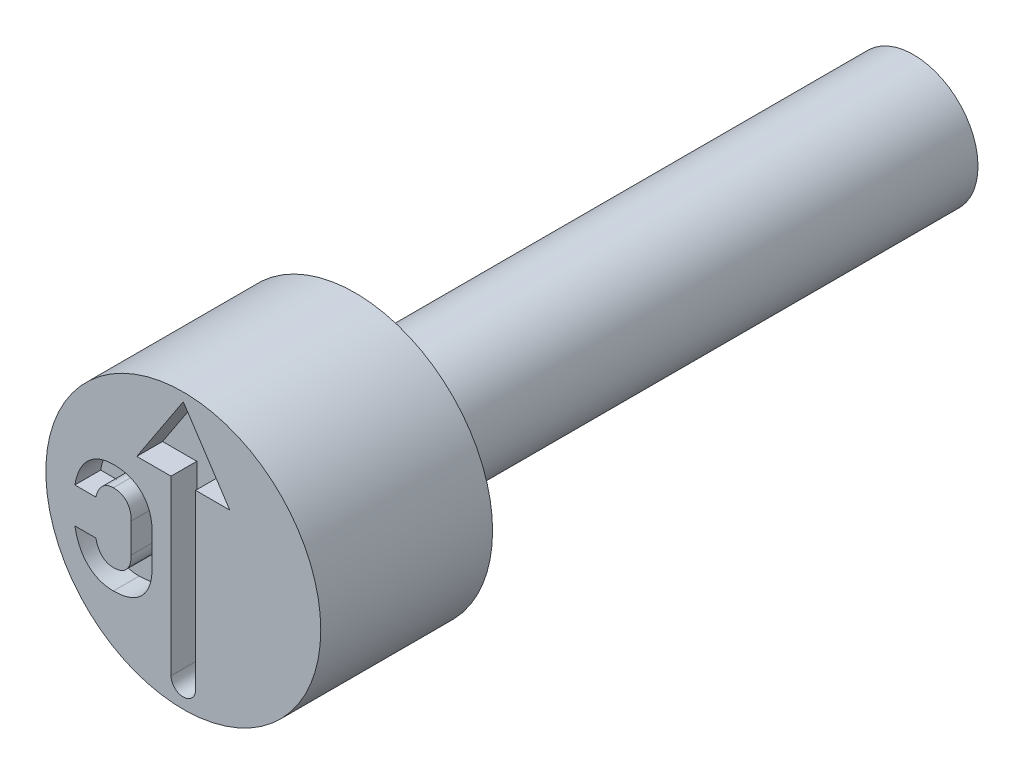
ISO-10303-21;
HEADER;
FILE_DESCRIPTION(('STEP AP214'),'2;1');
FILE_NAME('part.step','',(''),(''),'','','');
FILE_SCHEMA(('AUTOMOTIVE_DESIGN { 1 0 10303 214 1 1 1 1 }'));
ENDSEC;
DATA;
#1=APPLICATION_CONTEXT('core data for automotive mechanical design processes');
#2=APPLICATION_PROTOCOL_DEFINITION('international standard','automotive_design',2000,#1);
#3=PRODUCT_CONTEXT('',#1,'mechanical');
#4=PRODUCT('Part','Part','',(#3));
#5=PRODUCT_RELATED_PRODUCT_CATEGORY('part','',(#4));
#6=PRODUCT_DEFINITION_FORMATION('','',#4);
#7=PRODUCT_DEFINITION_CONTEXT('part definition',#1,'design');
#8=PRODUCT_DEFINITION('design','',#6,#7);
#9=PRODUCT_DEFINITION_SHAPE('','',#8);
#10=(LENGTH_UNIT() NAMED_UNIT(*) SI_UNIT(.MILLI.,.METRE.));
#11=(NAMED_UNIT(*) PLANE_ANGLE_UNIT() SI_UNIT($,.RADIAN.));
#12=(NAMED_UNIT(*) SI_UNIT($,.STERADIAN.) SOLID_ANGLE_UNIT());
#13=UNCERTAINTY_MEASURE_WITH_UNIT(LENGTH_MEASURE(1.E-05),#10,'distance_accuracy_value','');
#14=(GEOMETRIC_REPRESENTATION_CONTEXT(3) GLOBAL_UNCERTAINTY_ASSIGNED_CONTEXT((#13)) GLOBAL_UNIT_ASSIGNED_CONTEXT((#10,
#11,#12)) REPRESENTATION_CONTEXT('',''));
#15=CARTESIAN_POINT('',(0.,0.,0.));
#16=DIRECTION('',(0.,0.,1.));
#17=DIRECTION('',(1.,0.,0.));
#18=AXIS2_PLACEMENT_3D('',#15,#16,#17);
#19=CARTESIAN_POINT('',(0.,1.5,-4.));
#20=DIRECTION('',(0.,0.,1.));
#21=DIRECTION('',(1.,0.,0.));
#22=AXIS2_PLACEMENT_3D('',#19,#20,#21);
#23=PLANE('',#22);
#24=CARTESIAN_POINT('',(0.,0.,-4.));
#25=DIRECTION('',(0.,0.,1.));
#26=DIRECTION('',(1.,0.,0.));
#27=AXIS2_PLACEMENT_3D('',#24,#25,#26);
#28=CIRCLE('',#27,3.2);
#29=CARTESIAN_POINT('',(3.2,0.,-4.));
#30=VERTEX_POINT('',#29);
#31=EDGE_CURVE('E11',#30,#30,#28,.T.);
#32=ORIENTED_EDGE('',*,*,#31,.F.);
#33=EDGE_LOOP('',(#32));
#34=FACE_BOUND('',#33,.T.);
#35=CARTESIAN_POINT('',(0.,0.,-4.));
#36=DIRECTION('',(0.,0.,1.));
#37=DIRECTION('',(1.,0.,0.));
#38=AXIS2_PLACEMENT_3D('',#35,#36,#37);
#39=CIRCLE('',#38,1.5);
#40=CARTESIAN_POINT('',(1.5,0.,-4.));
#41=VERTEX_POINT('',#40);
#42=EDGE_CURVE('E262',#41,#41,#39,.T.);
#43=ORIENTED_EDGE('',*,*,#42,.T.);
#44=EDGE_LOOP('',(#43));
#45=FACE_BOUND('',#44,.T.);
#46=ADVANCED_FACE('F34',(#34,#45),#23,.F.);
#47=CARTESIAN_POINT('',(0.,0.,-0.403888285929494));
#48=DIRECTION('',(0.,0.,1.));
#49=DIRECTION('',(1.,0.,0.));
#50=AXIS2_PLACEMENT_3D('',#47,#48,#49);
#51=CYLINDRICAL_SURFACE('',#50,3.2);
#52=CARTESIAN_POINT('',(0.,0.,0.));
#53=DIRECTION('',(0.,0.,1.));
#54=DIRECTION('',(1.,0.,0.));
#55=AXIS2_PLACEMENT_3D('',#52,#53,#54);
#56=CIRCLE('',#55,3.2);
#57=CARTESIAN_POINT('',(3.2,0.,0.));
#58=VERTEX_POINT('',#57);
#59=EDGE_CURVE('E41',#58,#58,#56,.T.);
#60=ORIENTED_EDGE('',*,*,#59,.F.);
#61=EDGE_LOOP('',(#60));
#62=FACE_BOUND('',#61,.T.);
#63=ORIENTED_EDGE('',*,*,#31,.T.);
#64=EDGE_LOOP('',(#63));
#65=FACE_BOUND('',#64,.T.);
#66=ADVANCED_FACE('F247',(#62,#65),#51,.T.);
#67=CARTESIAN_POINT('',(0.,3.2,0.));
#68=DIRECTION('',(0.,0.,-1.));
#69=DIRECTION('',(-1.,0.,0.));
#70=AXIS2_PLACEMENT_3D('',#67,#68,#69);
#71=PLANE('',#70);
#72=CARTESIAN_POINT('',(-1.62798043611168,-1.62598328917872,0.));
#73=CARTESIAN_POINT('',(-1.60470520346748,-1.62573152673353,0.));
#74=CARTESIAN_POINT('',(-1.55877595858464,-1.62523472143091,0.));
#75=CARTESIAN_POINT('',(-1.49124071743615,-1.62006537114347,0.));
#76=CARTESIAN_POINT('',(-1.42608575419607,-1.61142404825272,0.));
#77=CARTESIAN_POINT('',(-1.36366637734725,-1.59923824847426,0.));
#78=CARTESIAN_POINT('',(-1.30381016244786,-1.58386551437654,0.));
#79=CARTESIAN_POINT('',(-1.24626084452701,-1.56569537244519,0.));
#80=CARTESIAN_POINT('',(-1.19157216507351,-1.54320154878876,0.));
#81=CARTESIAN_POINT('',(-1.13921332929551,-1.51769313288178,0.));
#82=CARTESIAN_POINT('',(-1.08992165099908,-1.48882154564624,0.));
#83=CARTESIAN_POINT('',(-1.04380158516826,-1.45634704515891,0.));
#84=CARTESIAN_POINT('',(-1.0003958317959,-1.4212885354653,0.));
#85=CARTESIAN_POINT('',(-0.960033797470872,-1.38294304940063,0.));
#86=CARTESIAN_POINT('',(-0.922757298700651,-1.34153464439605,0.));
#87=CARTESIAN_POINT('',(-0.888354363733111,-1.29701741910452,0.));
#88=CARTESIAN_POINT('',(-0.857531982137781,-1.24910737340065,0.));
#89=CARTESIAN_POINT('',(-0.829335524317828,-1.19845009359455,0.));
#90=CARTESIAN_POINT('',(-0.804249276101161,-1.14490712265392,0.));
#91=CARTESIAN_POINT('',(-0.783076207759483,-1.08822290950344,0.));
#92=CARTESIAN_POINT('',(-0.764719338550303,-1.02902336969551,0.));
#93=CARTESIAN_POINT('',(-0.749363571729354,-0.967317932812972,0.));
#94=CARTESIAN_POINT('',(-0.737606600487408,-0.902826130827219,0.));
#95=CARTESIAN_POINT('',(-0.729769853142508,-0.835596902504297,0.));
#96=CARTESIAN_POINT('',(-0.724337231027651,-0.765566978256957,0.));
#97=CARTESIAN_POINT('',(-0.723888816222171,-0.717937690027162,0.));
#98=CARTESIAN_POINT('',(-0.723660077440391,-0.693641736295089,0.));
#99=B_SPLINE_CURVE_WITH_KNOTS('',3,(#72,#73,#74,#75,#76,#77,#78,#79,#80,#81,#82,#83,#84,#85,#86,
#87,#88,#89,#90,#91,#92,#93,#94,#95,#96,#97,#98),.UNSPECIFIED.,.F.,.F.,(4,1,1,1,1,1,1,1,1,1,1,1,
1,1,1,1,1,1,1,1,1,1,1,1,4),(0.,0.0472598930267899,0.093258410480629,0.137448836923,
0.180669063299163,0.222325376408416,0.262898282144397,0.303117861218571,0.342294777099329,
0.381096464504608,0.418984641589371,0.456742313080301,0.494310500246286,0.531916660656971,
0.569787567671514,0.608434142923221,0.647492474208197,0.687453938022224,0.728384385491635,
0.770272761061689,0.813266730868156,0.85743965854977,0.903297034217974,0.950671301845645,1.),.UNSPECIFIED.);
#100=CARTESIAN_POINT('',(-1.62798043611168,-1.62598328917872,0.));
#101=VERTEX_POINT('',#100);
#102=CARTESIAN_POINT('',(-0.723660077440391,-0.693641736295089,0.));
#103=VERTEX_POINT('',#102);
#104=EDGE_CURVE('E400',#101,#103,#99,.T.);
#105=ORIENTED_EDGE('',*,*,#104,.F.);
#106=CARTESIAN_POINT('',(-2.52363969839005,-0.762421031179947,0.));
#107=CARTESIAN_POINT('',(-2.51493265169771,-0.806597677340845,0.));
#108=CARTESIAN_POINT('',(-2.49800456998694,-0.892485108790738,0.));
#109=CARTESIAN_POINT('',(-2.45996424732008,-1.01479487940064,0.));
#110=CARTESIAN_POINT('',(-2.41308611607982,-1.12717032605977,0.));
#111=CARTESIAN_POINT('',(-2.35729852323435,-1.22944289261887,0.));
#112=CARTESIAN_POINT('',(-2.29226136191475,-1.32060127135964,0.));
#113=CARTESIAN_POINT('',(-2.21953076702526,-1.40098638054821,0.));
#114=CARTESIAN_POINT('',(-2.1384921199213,-1.4699198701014,0.));
#115=CARTESIAN_POINT('',(-2.04931211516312,-1.52670905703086,0.));
#116=CARTESIAN_POINT('',(-1.9530185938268,-1.57135411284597,0.));
#117=CARTESIAN_POINT('',(-1.85013854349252,-1.60270726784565,0.));
#118=CARTESIAN_POINT('',(-1.74120212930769,-1.62299116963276,0.));
#119=CARTESIAN_POINT('',(-1.66628431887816,-1.62497102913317,0.));
#120=CARTESIAN_POINT('',(-1.62798043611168,-1.62598328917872,0.));
#121=B_SPLINE_CURVE_WITH_KNOTS('',3,(#106,#107,#108,#109,#110,#111,#112,#113,#114,#115,#116,
#117,#118,#119,#120),.UNSPECIFIED.,.F.,.F.,(4,1,1,1,1,1,1,1,1,1,1,1,4),(0.,0.098823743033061,
0.192131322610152,0.28071953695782,0.365844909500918,0.447392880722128,0.52606487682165,
0.603327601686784,0.680299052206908,0.757555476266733,0.835645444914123,0.915969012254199,1.),.UNSPECIFIED.);
#122=CARTESIAN_POINT('',(-2.52363969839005,-0.762421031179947,0.));
#123=VERTEX_POINT('',#122);
#124=EDGE_CURVE('E48',#123,#101,#121,.T.);
#125=ORIENTED_EDGE('',*,*,#124,.F.);
#126=DIRECTION('',(-1.,0.,0.));
#127=VECTOR('',#126,1.);
#128=CARTESIAN_POINT('',(-2.03556144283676,-0.762421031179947,0.));
#129=LINE('',#128,#127);
#130=CARTESIAN_POINT('',(-2.03556144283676,-0.762421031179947,0.));
#131=VERTEX_POINT('',#130);
#132=EDGE_CURVE('E185',#131,#123,#129,.T.);
#133=ORIENTED_EDGE('',*,*,#132,.F.);
#134=CARTESIAN_POINT('',(-1.62798043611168,-1.15471775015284,0.));
#135=CARTESIAN_POINT('',(-1.64481995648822,-1.15405416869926,0.));
#136=CARTESIAN_POINT('',(-1.67784877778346,-1.152752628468,0.));
#137=CARTESIAN_POINT('',(-1.72610053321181,-1.14478488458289,0.));
#138=CARTESIAN_POINT('',(-1.77153110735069,-1.13010074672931,0.));
#139=CARTESIAN_POINT('',(-1.81444709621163,-1.11031582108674,0.));
#140=CARTESIAN_POINT('',(-1.85453391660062,-1.08475412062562,0.));
#141=CARTESIAN_POINT('',(-1.89064880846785,-1.05317105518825,0.));
#142=CARTESIAN_POINT('',(-1.92428771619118,-1.01722018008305,0.));
#143=CARTESIAN_POINT('',(-1.95422741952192,-0.975731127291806,0.));
#144=CARTESIAN_POINT('',(-1.98076780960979,-0.929302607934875,0.));
#145=CARTESIAN_POINT('',(-2.00296295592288,-0.8779167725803,0.));
#146=CARTESIAN_POINT('',(-2.02222907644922,-0.822145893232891,0.));
#147=CARTESIAN_POINT('',(-2.03102630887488,-0.78273702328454,0.));
#148=CARTESIAN_POINT('',(-2.03556144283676,-0.762421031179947,0.));
#149=B_SPLINE_CURVE_WITH_KNOTS('',3,(#134,#135,#136,#137,#138,#139,#140,#141,#142,#143,#144,
#145,#146,#147,#148),.UNSPECIFIED.,.F.,.F.,(4,1,1,1,1,1,1,1,1,1,1,1,4),(0.,0.0817564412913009,
0.160356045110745,0.236478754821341,0.312819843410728,0.389192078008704,0.466352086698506,
0.545094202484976,0.627698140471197,0.714093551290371,0.80415108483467,0.89903630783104,1.),.UNSPECIFIED.);
#150=CARTESIAN_POINT('',(-1.62798043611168,-1.15471775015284,0.));
#151=VERTEX_POINT('',#150);
#152=EDGE_CURVE('E188',#151,#131,#149,.T.);
#153=ORIENTED_EDGE('',*,*,#152,.F.);
#154=CARTESIAN_POINT('',(-1.21173833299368,-0.693641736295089,0.));
#155=CARTESIAN_POINT('',(-1.21228750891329,-0.717108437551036,0.));
#156=CARTESIAN_POINT('',(-1.21335059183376,-0.762534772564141,0.));
#157=CARTESIAN_POINT('',(-1.2225605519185,-0.827978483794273,0.));
#158=CARTESIAN_POINT('',(-1.2377978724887,-0.888176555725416,0.));
#159=CARTESIAN_POINT('',(-1.25893792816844,-0.943026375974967,0.));
#160=CARTESIAN_POINT('',(-1.28670690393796,-0.991745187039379,0.));
#161=CARTESIAN_POINT('',(-1.31968459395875,-1.03472652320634,0.));
#162=CARTESIAN_POINT('',(-1.35806152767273,-1.07186656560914,0.));
#163=CARTESIAN_POINT('',(-1.4024333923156,-1.10208483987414,0.));
#164=CARTESIAN_POINT('',(-1.45193242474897,-1.12572189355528,0.));
#165=CARTESIAN_POINT('',(-1.50636920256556,-1.14233701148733,0.));
#166=CARTESIAN_POINT('',(-1.56559867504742,-1.15276668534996,0.));
#167=CARTESIAN_POINT('',(-1.60670678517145,-1.15405239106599,0.));
#168=CARTESIAN_POINT('',(-1.62798043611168,-1.15471775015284,0.));
#169=B_SPLINE_CURVE_WITH_KNOTS('',3,(#154,#155,#156,#157,#158,#159,#160,#161,#162,#163,#164,
#165,#166,#167,#168),.UNSPECIFIED.,.F.,.F.,(4,1,1,1,1,1,1,1,1,1,1,1,4),(0.,0.0997433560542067,
0.193081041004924,0.28029932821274,0.363302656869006,0.442209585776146,0.517891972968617,
0.592965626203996,0.668275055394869,0.745143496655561,0.825309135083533,0.909596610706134,1.),.UNSPECIFIED.);
#170=CARTESIAN_POINT('',(-1.21173833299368,-0.693641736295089,0.));
#171=VERTEX_POINT('',#170);
#172=EDGE_CURVE('E348',#171,#151,#169,.T.);
#173=ORIENTED_EDGE('',*,*,#172,.F.);
#174=DIRECTION('',(0.,-1.,0.));
#175=VECTOR('',#174,1.);
#176=CARTESIAN_POINT('',(-1.21173833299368,-0.00788669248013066,0.));
#177=LINE('',#176,#175);
#178=CARTESIAN_POINT('',(-1.21173833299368,-0.00788669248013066,0.));
#179=VERTEX_POINT('',#178);
#180=EDGE_CURVE('E356',#179,#171,#177,.T.);
#181=ORIENTED_EDGE('',*,*,#180,.F.);
#182=CARTESIAN_POINT('',(-1.62798043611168,0.454717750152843,0.));
#183=CARTESIAN_POINT('',(-1.60672265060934,0.453973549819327,0.));
#184=CARTESIAN_POINT('',(-1.56567358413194,0.452536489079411,0.));
#185=CARTESIAN_POINT('',(-1.50620662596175,0.443174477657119,0.));
#186=CARTESIAN_POINT('',(-1.45203880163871,0.425537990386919,0.));
#187=CARTESIAN_POINT('',(-1.40241358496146,0.402141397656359,0.));
#188=CARTESIAN_POINT('',(-1.35808277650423,0.371838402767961,0.));
#189=CARTESIAN_POINT('',(-1.31952154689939,0.334689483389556,0.));
#190=CARTESIAN_POINT('',(-1.28671043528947,0.291198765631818,0.));
#191=CARTESIAN_POINT('',(-1.25906239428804,0.242114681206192,0.));
#192=CARTESIAN_POINT('',(-1.23768438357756,0.187020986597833,0.));
#193=CARTESIAN_POINT('',(-1.22264252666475,0.126597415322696,0.));
#194=CARTESIAN_POINT('',(-1.21333426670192,0.0610107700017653,0.));
#195=CARTESIAN_POINT('',(-1.2122819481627,0.0155815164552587,0.));
#196=CARTESIAN_POINT('',(-1.21173833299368,-0.00788669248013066,0.));
#197=B_SPLINE_CURVE_WITH_KNOTS('',3,(#182,#183,#184,#185,#186,#187,#188,#189,#190,#191,#192,
#193,#194,#195,#196),.UNSPECIFIED.,.F.,.F.,(4,1,1,1,1,1,1,1,1,1,1,1,4),(0.,0.0902231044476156,
0.174222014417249,0.25444494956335,0.331160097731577,0.406319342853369,0.481243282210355,
0.557346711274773,0.636723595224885,0.719561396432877,0.807304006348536,0.900455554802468,1.),.UNSPECIFIED.);
#198=CARTESIAN_POINT('',(-1.62798043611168,0.454717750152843,0.));
#199=VERTEX_POINT('',#198);
#200=EDGE_CURVE('E362',#199,#179,#197,.T.);
#201=ORIENTED_EDGE('',*,*,#200,.F.);
#202=CARTESIAN_POINT('',(-2.03556144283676,0.0629305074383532,0.));
#203=CARTESIAN_POINT('',(-2.03063827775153,0.0829004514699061,0.));
#204=CARTESIAN_POINT('',(-2.02105824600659,0.121760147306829,0.));
#205=CARTESIAN_POINT('',(-2.00133365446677,0.177041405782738,0.));
#206=CARTESIAN_POINT('',(-1.97890482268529,0.228246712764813,0.));
#207=CARTESIAN_POINT('',(-1.95147442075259,0.274156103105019,0.));
#208=CARTESIAN_POINT('',(-1.92161335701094,0.315878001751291,0.));
#209=CARTESIAN_POINT('',(-1.88793698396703,0.352024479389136,0.));
#210=CARTESIAN_POINT('',(-1.85118239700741,0.383195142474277,0.));
#211=CARTESIAN_POINT('',(-1.8116334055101,0.408975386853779,0.));
#212=CARTESIAN_POINT('',(-1.76939770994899,0.429985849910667,0.));
#213=CARTESIAN_POINT('',(-1.724283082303,0.443890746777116,0.));
#214=CARTESIAN_POINT('',(-1.67691233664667,0.452970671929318,0.));
#215=CARTESIAN_POINT('',(-1.64449658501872,0.454128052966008,0.));
#216=CARTESIAN_POINT('',(-1.62798043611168,0.454717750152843,0.));
#217=B_SPLINE_CURVE_WITH_KNOTS('',3,(#202,#203,#204,#205,#206,#207,#208,#209,#210,#211,#212,
#213,#214,#215,#216),.UNSPECIFIED.,.F.,.F.,(4,1,1,1,1,1,1,1,1,1,1,1,4),(0.,0.100258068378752,
0.195093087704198,0.285925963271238,0.37244127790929,0.455447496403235,0.535743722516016,
0.612742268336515,0.689936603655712,0.765509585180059,0.842003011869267,0.919498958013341,1.),.UNSPECIFIED.);
#218=CARTESIAN_POINT('',(-2.03556144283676,0.0629305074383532,0.));
#219=VERTEX_POINT('',#218);
#220=EDGE_CURVE('E367',#219,#199,#217,.T.);
#221=ORIENTED_EDGE('',*,*,#220,.F.);
#222=DIRECTION('',(1.,0.,0.));
#223=VECTOR('',#222,1.);
#224=CARTESIAN_POINT('',(-2.52363969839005,0.0629305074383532,0.));
#225=LINE('',#224,#223);
#226=CARTESIAN_POINT('',(-2.52363969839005,0.0629305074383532,0.));
#227=VERTEX_POINT('',#226);
#228=EDGE_CURVE('E375',#227,#219,#225,.T.);
#229=ORIENTED_EDGE('',*,*,#228,.F.);
#230=CARTESIAN_POINT('',(-1.62798043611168,0.925983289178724,0.));
#231=CARTESIAN_POINT('',(-1.66628239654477,0.924958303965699,0.));
#232=CARTESIAN_POINT('',(-1.74136378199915,0.922949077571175,0.));
#233=CARTESIAN_POINT('',(-1.85048873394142,0.902775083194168,0.));
#234=CARTESIAN_POINT('',(-1.95353834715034,0.871366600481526,0.));
#235=CARTESIAN_POINT('',(-2.04991036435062,0.826580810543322,0.));
#236=CARTESIAN_POINT('',(-2.13930307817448,0.770074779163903,0.));
#237=CARTESIAN_POINT('',(-2.22066991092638,0.701324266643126,0.));
#238=CARTESIAN_POINT('',(-2.29398349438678,0.621229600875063,0.));
#239=CARTESIAN_POINT('',(-2.3586109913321,0.529463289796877,0.));
#240=CARTESIAN_POINT('',(-2.41473649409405,0.427305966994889,0.));
#241=CARTESIAN_POINT('',(-2.46094114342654,0.314745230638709,0.));
#242=CARTESIAN_POINT('',(-2.49844561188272,0.192620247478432,0.));
#243=CARTESIAN_POINT('',(-2.51509155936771,0.10693313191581,0.));
#244=CARTESIAN_POINT('',(-2.52363969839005,0.0629305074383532,0.));
#245=B_SPLINE_CURVE_WITH_KNOTS('',3,(#230,#231,#232,#233,#234,#235,#236,#237,#238,#239,#240,
#241,#242,#243,#244),.UNSPECIFIED.,.F.,.F.,(4,1,1,1,1,1,1,1,1,1,1,1,4),(0.,0.0840057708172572,
0.164672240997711,0.242738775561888,0.319972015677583,0.397234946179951,0.474233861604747,
0.553133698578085,0.634960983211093,0.720060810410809,0.808478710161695,0.901648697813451,1.),.UNSPECIFIED.);
#246=CARTESIAN_POINT('',(-1.62798043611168,0.925983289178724,0.));
#247=VERTEX_POINT('',#246);
#248=EDGE_CURVE('E381',#247,#227,#245,.T.);
#249=ORIENTED_EDGE('',*,*,#248,.F.);
#250=CARTESIAN_POINT('',(-0.723660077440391,-0.00788669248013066,0.));
#251=CARTESIAN_POINT('',(-0.723888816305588,0.0164092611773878,0.));
#252=CARTESIAN_POINT('',(-0.724337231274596,0.0640385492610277,0.));
#253=CARTESIAN_POINT('',(-0.729769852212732,0.134068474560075,0.));
#254=CARTESIAN_POINT('',(-0.73760660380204,0.201297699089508,0.));
#255=CARTESIAN_POINT('',(-0.749363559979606,0.265789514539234,0.));
#256=CARTESIAN_POINT('',(-0.764719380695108,0.327494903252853,0.));
#257=CARTESIAN_POINT('',(-0.78307605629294,0.386694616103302,0.));
#258=CARTESIAN_POINT('',(-0.804249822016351,0.44337820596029,0.));
#259=CARTESIAN_POINT('',(-0.829333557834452,0.496923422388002,0.));
#260=CARTESIAN_POINT('',(-0.857539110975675,0.547572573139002,0.));
#261=CARTESIAN_POINT('',(-0.888328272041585,0.595512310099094,0.));
#262=CARTESIAN_POINT('',(-0.92292997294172,0.640021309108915,0.));
#263=CARTESIAN_POINT('',(-0.959852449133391,0.681916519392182,0.));
#264=CARTESIAN_POINT('',(-1.00041856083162,0.720250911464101,0.));
#265=CARTESIAN_POINT('',(-1.04380040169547,0.755322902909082,0.));
#266=CARTESIAN_POINT('',(-1.0899033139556,0.787842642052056,0.));
#267=CARTESIAN_POINT('',(-1.13935550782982,0.816552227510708,0.));
#268=CARTESIAN_POINT('',(-1.19141279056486,0.842859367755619,0.));
#269=CARTESIAN_POINT('',(-1.24638481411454,0.864996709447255,0.));
#270=CARTESIAN_POINT('',(-1.30369732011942,0.884036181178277,0.));
#271=CARTESIAN_POINT('',(-1.36368380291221,0.899186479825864,0.));
#272=CARTESIAN_POINT('',(-1.42608090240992,0.911438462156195,0.));
#273=CARTESIAN_POINT('',(-1.49124208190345,0.920061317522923,0.));
#274=CARTESIAN_POINT('',(-1.55877560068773,0.925235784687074,0.));
#275=CARTESIAN_POINT('',(-1.60470508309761,0.925731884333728,0.));
#276=CARTESIAN_POINT('',(-1.62798043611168,0.925983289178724,0.));
#277=B_SPLINE_CURVE_WITH_KNOTS('',3,(#250,#251,#252,#253,#254,#255,#256,#257,#258,#259,#260,
#261,#262,#263,#264,#265,#266,#267,#268,#269,#270,#271,#272,#273,#274,#275,#276),.UNSPECIFIED.,
.F.,.F.,(4,1,1,1,1,1,1,1,1,1,1,1,1,1,1,1,1,1,1,1,1,1,1,1,4),(0.,0.0493032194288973,
0.0966530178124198,0.142486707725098,0.186636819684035,0.229608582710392,0.271475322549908,
0.31238462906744,0.352325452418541,0.391363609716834,0.429990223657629,0.467841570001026,
0.505685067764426,0.543233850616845,0.580972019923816,0.618840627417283,0.657622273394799,
0.696931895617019,0.737130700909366,0.777789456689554,0.819424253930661,0.862622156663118,
0.906789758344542,0.952764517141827,1.),.UNSPECIFIED.);
#278=CARTESIAN_POINT('',(-0.723660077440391,-0.00788669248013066,0.));
#279=VERTEX_POINT('',#278);
#280=EDGE_CURVE('E386',#279,#247,#277,.T.);
#281=ORIENTED_EDGE('',*,*,#280,.F.);
#282=DIRECTION('',(0.,1.,0.));
#283=VECTOR('',#282,1.);
#284=CARTESIAN_POINT('',(-0.723660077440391,-0.693641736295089,0.));
#285=LINE('',#284,#283);
#286=EDGE_CURVE('E394',#103,#279,#285,.T.);
#287=ORIENTED_EDGE('',*,*,#286,.F.);
#288=EDGE_LOOP('',(#105,#125,#133,#153,#173,#181,#201,#221,#229,#249,#281,#287));
#289=FACE_BOUND('',#288,.T.);
#290=DIRECTION('',(0.,1.,0.));
#291=VECTOR('',#290,1.);
#292=CARTESIAN_POINT('',(0.28570968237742,1.35952714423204,0.));
#293=LINE('',#292,#291);
#294=CARTESIAN_POINT('',(0.285709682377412,-2.66424275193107,0.));
#295=VERTEX_POINT('',#294);
#296=CARTESIAN_POINT('',(0.28570968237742,1.35952714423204,0.));
#297=VERTEX_POINT('',#296);
#298=EDGE_CURVE('E300',#295,#297,#293,.T.);
#299=ORIENTED_EDGE('',*,*,#298,.F.);
#300=CARTESIAN_POINT('',(2.4513673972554E-13,-2.66424275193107,0.));
#301=DIRECTION('',(0.,0.,1.));
#302=DIRECTION('',(1.,0.,0.));
#303=AXIS2_PLACEMENT_3D('',#300,#301,#302);
#304=CIRCLE('',#303,0.285709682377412);
#305=CARTESIAN_POINT('',(-0.285709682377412,-2.66424275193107,0.));
#306=VERTEX_POINT('',#305);
#307=EDGE_CURVE('E56',#306,#295,#304,.T.);
#308=ORIENTED_EDGE('',*,*,#307,.F.);
#309=DIRECTION('',(0.,-1.,0.));
#310=VECTOR('',#309,1.);
#311=CARTESIAN_POINT('',(-0.28570968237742,1.35952714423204,0.));
#312=LINE('',#311,#310);
#313=CARTESIAN_POINT('',(-0.28570968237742,1.35952714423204,0.));
#314=VERTEX_POINT('',#313);
#315=EDGE_CURVE('E284',#314,#306,#312,.T.);
#316=ORIENTED_EDGE('',*,*,#315,.F.);
#317=DIRECTION('',(1.,0.,0.));
#318=VECTOR('',#317,1.);
#319=CARTESIAN_POINT('',(-1.08287651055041,1.35952714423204,0.));
#320=LINE('',#319,#318);
#321=CARTESIAN_POINT('',(-1.08287651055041,1.35952714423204,0.));
#322=VERTEX_POINT('',#321);
#323=EDGE_CURVE('E288',#322,#314,#320,.T.);
#324=ORIENTED_EDGE('',*,*,#323,.F.);
#325=DIRECTION('',(-0.550159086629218,-0.835059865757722,0.));
#326=VECTOR('',#325,1.);
#327=CARTESIAN_POINT('',(0.,3.00317301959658,0.));
#328=LINE('',#327,#326);
#329=CARTESIAN_POINT('',(0.,3.00317301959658,0.));
#330=VERTEX_POINT('',#329);
#331=EDGE_CURVE('E291',#330,#322,#328,.T.);
#332=ORIENTED_EDGE('',*,*,#331,.F.);
#333=DIRECTION('',(-0.550159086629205,0.835059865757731,0.));
#334=VECTOR('',#333,1.);
#335=CARTESIAN_POINT('',(0.,3.00317301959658,0.));
#336=LINE('',#335,#334);
#337=CARTESIAN_POINT('',(1.08287651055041,1.35952714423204,0.));
#338=VERTEX_POINT('',#337);
#339=EDGE_CURVE('E294',#338,#330,#336,.T.);
#340=ORIENTED_EDGE('',*,*,#339,.F.);
#341=DIRECTION('',(1.,0.,0.));
#342=VECTOR('',#341,1.);
#343=CARTESIAN_POINT('',(1.08287651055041,1.35952714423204,0.));
#344=LINE('',#343,#342);
#345=EDGE_CURVE('E297',#297,#338,#344,.T.);
#346=ORIENTED_EDGE('',*,*,#345,.F.);
#347=EDGE_LOOP('',(#299,#308,#316,#324,#332,#340,#346));
#348=FACE_BOUND('',#347,.T.);
#349=ORIENTED_EDGE('',*,*,#59,.T.);
#350=EDGE_LOOP('',(#349));
#351=FACE_BOUND('',#350,.T.);
#352=ADVANCED_FACE('F244',(#289,#348,#351),#71,.F.);
#353=CARTESIAN_POINT('',(0.,0.,-17.));
#354=DIRECTION('',(0.,0.,1.));
#355=DIRECTION('',(1.,0.,0.));
#356=AXIS2_PLACEMENT_3D('',#353,#354,#355);
#357=PLANE('',#356);
#358=CARTESIAN_POINT('',(0.,0.,-17.));
#359=DIRECTION('',(0.,0.,1.));
#360=DIRECTION('',(1.,0.,0.));
#361=AXIS2_PLACEMENT_3D('',#358,#359,#360);
#362=CIRCLE('',#361,1.5);
#363=CARTESIAN_POINT('',(1.5,0.,-17.));
#364=VERTEX_POINT('',#363);
#365=EDGE_CURVE('E263',#364,#364,#362,.T.);
#366=ORIENTED_EDGE('',*,*,#365,.F.);
#367=EDGE_LOOP('',(#366));
#368=FACE_BOUND('',#367,.T.);
#369=ADVANCED_FACE('F240',(#368),#357,.F.);
#370=CARTESIAN_POINT('',(0.,0.,-0.403888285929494));
#371=DIRECTION('',(0.,0.,1.));
#372=DIRECTION('',(1.,0.,0.));
#373=AXIS2_PLACEMENT_3D('',#370,#371,#372);
#374=CYLINDRICAL_SURFACE('',#373,1.5);
#375=ORIENTED_EDGE('',*,*,#42,.F.);
#376=EDGE_LOOP('',(#375));
#377=FACE_BOUND('',#376,.T.);
#378=ORIENTED_EDGE('',*,*,#365,.T.);
#379=EDGE_LOOP('',(#378));
#380=FACE_BOUND('',#379,.T.);
#381=ADVANCED_FACE('F237',(#377,#380),#374,.T.);
#382=CARTESIAN_POINT('',(2.4513673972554E-13,-2.66424275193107,-0.6));
#383=DIRECTION('',(0.,0.,1.));
#384=DIRECTION('',(1.,0.,0.));
#385=AXIS2_PLACEMENT_3D('',#382,#383,#384);
#386=CYLINDRICAL_SURFACE('',#385,0.285709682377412);
#387=ORIENTED_EDGE('',*,*,#307,.T.);
#388=DIRECTION('',(0.,0.,1.));
#389=VECTOR('',#388,1.);
#390=CARTESIAN_POINT('',(0.285709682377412,-2.66424275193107,-0.6));
#391=LINE('',#390,#389);
#392=CARTESIAN_POINT('',(0.285709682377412,-2.66424275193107,-0.6));
#393=VERTEX_POINT('',#392);
#394=EDGE_CURVE('E271',#393,#295,#391,.T.);
#395=ORIENTED_EDGE('',*,*,#394,.F.);
#396=CARTESIAN_POINT('',(2.4513673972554E-13,-2.66424275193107,-0.6));
#397=DIRECTION('',(0.,0.,1.));
#398=DIRECTION('',(1.,0.,0.));
#399=AXIS2_PLACEMENT_3D('',#396,#397,#398);
#400=CIRCLE('',#399,0.285709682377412);
#401=CARTESIAN_POINT('',(-0.285709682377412,-2.66424275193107,-0.6));
#402=VERTEX_POINT('',#401);
#403=EDGE_CURVE('E287',#402,#393,#400,.T.);
#404=ORIENTED_EDGE('',*,*,#403,.F.);
#405=DIRECTION('',(0.,0.,1.));
#406=VECTOR('',#405,1.);
#407=CARTESIAN_POINT('',(-0.285709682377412,-2.66424275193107,-0.6));
#408=LINE('',#407,#406);
#409=EDGE_CURVE('E264',#402,#306,#408,.T.);
#410=ORIENTED_EDGE('',*,*,#409,.T.);
#411=EDGE_LOOP('',(#387,#395,#404,#410));
#412=FACE_BOUND('',#411,.T.);
#413=ADVANCED_FACE('F215',(#412),#386,.F.);
#414=CARTESIAN_POINT('',(-0.28570968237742,1.35952714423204,-0.6));
#415=DIRECTION('',(-1.,0.,0.));
#416=DIRECTION('',(0.,-1.,0.));
#417=AXIS2_PLACEMENT_3D('',#414,#415,#416);
#418=PLANE('',#417);
#419=ORIENTED_EDGE('',*,*,#315,.T.);
#420=ORIENTED_EDGE('',*,*,#409,.F.);
#421=DIRECTION('',(0.,-1.,0.));
#422=VECTOR('',#421,1.);
#423=CARTESIAN_POINT('',(-0.28570968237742,1.35952714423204,-0.6));
#424=LINE('',#423,#422);
#425=CARTESIAN_POINT('',(-0.28570968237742,1.35952714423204,-0.6));
#426=VERTEX_POINT('',#425);
#427=EDGE_CURVE('E275',#426,#402,#424,.T.);
#428=ORIENTED_EDGE('',*,*,#427,.F.);
#429=DIRECTION('',(0.,0.,1.));
#430=VECTOR('',#429,1.);
#431=CARTESIAN_POINT('',(-0.28570968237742,1.35952714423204,-0.6));
#432=LINE('',#431,#430);
#433=EDGE_CURVE('E268',#426,#314,#432,.T.);
#434=ORIENTED_EDGE('',*,*,#433,.T.);
#435=EDGE_LOOP('',(#419,#420,#428,#434));
#436=FACE_BOUND('',#435,.T.);
#437=ADVANCED_FACE('F211',(#436),#418,.F.);
#438=CARTESIAN_POINT('',(-1.08287651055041,1.35952714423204,-0.6));
#439=DIRECTION('',(0.,-1.,0.));
#440=DIRECTION('',(0.,0.,-1.));
#441=AXIS2_PLACEMENT_3D('',#438,#439,#440);
#442=PLANE('',#441);
#443=ORIENTED_EDGE('',*,*,#323,.T.);
#444=ORIENTED_EDGE('',*,*,#433,.F.);
#445=DIRECTION('',(1.,0.,0.));
#446=VECTOR('',#445,1.);
#447=CARTESIAN_POINT('',(-1.08287651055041,1.35952714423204,-0.6));
#448=LINE('',#447,#446);
#449=CARTESIAN_POINT('',(-1.08287651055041,1.35952714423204,-0.6));
#450=VERTEX_POINT('',#449);
#451=EDGE_CURVE('E307',#450,#426,#448,.T.);
#452=ORIENTED_EDGE('',*,*,#451,.F.);
#453=DIRECTION('',(0.,0.,1.));
#454=VECTOR('',#453,1.);
#455=CARTESIAN_POINT('',(-1.08287651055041,1.35952714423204,-0.6));
#456=LINE('',#455,#454);
#457=EDGE_CURVE('E281',#450,#322,#456,.T.);
#458=ORIENTED_EDGE('',*,*,#457,.T.);
#459=EDGE_LOOP('',(#443,#444,#452,#458));
#460=FACE_BOUND('',#459,.T.);
#461=ADVANCED_FACE('F214',(#460),#442,.F.);
#462=CARTESIAN_POINT('',(0.,3.00317301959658,-0.6));
#463=DIRECTION('',(-0.835059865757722,0.550159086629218,0.));
#464=DIRECTION('',(-0.550159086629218,-0.835059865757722,0.));
#465=AXIS2_PLACEMENT_3D('',#462,#463,#464);
#466=PLANE('',#465);
#467=ORIENTED_EDGE('',*,*,#331,.T.);
#468=ORIENTED_EDGE('',*,*,#457,.F.);
#469=DIRECTION('',(-0.550159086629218,-0.835059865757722,0.));
#470=VECTOR('',#469,1.);
#471=CARTESIAN_POINT('',(0.,3.00317301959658,-0.6));
#472=LINE('',#471,#470);
#473=CARTESIAN_POINT('',(0.,3.00317301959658,-0.6));
#474=VERTEX_POINT('',#473);
#475=EDGE_CURVE('E310',#474,#450,#472,.T.);
#476=ORIENTED_EDGE('',*,*,#475,.F.);
#477=DIRECTION('',(0.,0.,1.));
#478=VECTOR('',#477,1.);
#479=CARTESIAN_POINT('',(0.,3.00317301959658,-0.6));
#480=LINE('',#479,#478);
#481=EDGE_CURVE('E279',#474,#330,#480,.T.);
#482=ORIENTED_EDGE('',*,*,#481,.T.);
#483=EDGE_LOOP('',(#467,#468,#476,#482));
#484=FACE_BOUND('',#483,.T.);
#485=ADVANCED_FACE('F219',(#484),#466,.F.);
#486=CARTESIAN_POINT('',(0.,3.00317301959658,-0.6));
#487=DIRECTION('',(0.835059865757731,0.550159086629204,0.));
#488=DIRECTION('',(-0.550159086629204,0.835059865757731,0.));
#489=AXIS2_PLACEMENT_3D('',#486,#487,#488);
#490=PLANE('',#489);
#491=ORIENTED_EDGE('',*,*,#339,.T.);
#492=ORIENTED_EDGE('',*,*,#481,.F.);
#493=DIRECTION('',(-0.550159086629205,0.835059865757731,0.));
#494=VECTOR('',#493,1.);
#495=CARTESIAN_POINT('',(0.,3.00317301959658,-0.6));
#496=LINE('',#495,#494);
#497=CARTESIAN_POINT('',(1.08287651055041,1.35952714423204,-0.6));
#498=VERTEX_POINT('',#497);
#499=EDGE_CURVE('E313',#498,#474,#496,.T.);
#500=ORIENTED_EDGE('',*,*,#499,.F.);
#501=DIRECTION('',(0.,0.,1.));
#502=VECTOR('',#501,1.);
#503=CARTESIAN_POINT('',(1.08287651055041,1.35952714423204,-0.6));
#504=LINE('',#503,#502);
#505=EDGE_CURVE('E277',#498,#338,#504,.T.);
#506=ORIENTED_EDGE('',*,*,#505,.T.);
#507=EDGE_LOOP('',(#491,#492,#500,#506));
#508=FACE_BOUND('',#507,.T.);
#509=ADVANCED_FACE('F223',(#508),#490,.F.);
#510=CARTESIAN_POINT('',(1.08287651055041,1.35952714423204,-0.6));
#511=DIRECTION('',(0.,-1.,0.));
#512=DIRECTION('',(0.,0.,-1.));
#513=AXIS2_PLACEMENT_3D('',#510,#511,#512);
#514=PLANE('',#513);
#515=ORIENTED_EDGE('',*,*,#345,.T.);
#516=ORIENTED_EDGE('',*,*,#505,.F.);
#517=DIRECTION('',(1.,0.,0.));
#518=VECTOR('',#517,1.);
#519=CARTESIAN_POINT('',(1.08287651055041,1.35952714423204,-0.6));
#520=LINE('',#519,#518);
#521=CARTESIAN_POINT('',(0.28570968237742,1.35952714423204,-0.6));
#522=VERTEX_POINT('',#521);
#523=EDGE_CURVE('E316',#522,#498,#520,.T.);
#524=ORIENTED_EDGE('',*,*,#523,.F.);
#525=DIRECTION('',(0.,0.,1.));
#526=VECTOR('',#525,1.);
#527=CARTESIAN_POINT('',(0.28570968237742,1.35952714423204,-0.6));
#528=LINE('',#527,#526);
#529=EDGE_CURVE('E274',#522,#297,#528,.T.);
#530=ORIENTED_EDGE('',*,*,#529,.T.);
#531=EDGE_LOOP('',(#515,#516,#524,#530));
#532=FACE_BOUND('',#531,.T.);
#533=ADVANCED_FACE('F227',(#532),#514,.F.);
#534=CARTESIAN_POINT('',(0.28570968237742,1.35952714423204,-0.6));
#535=DIRECTION('',(1.,0.,0.));
#536=DIRECTION('',(0.,1.,0.));
#537=AXIS2_PLACEMENT_3D('',#534,#535,#536);
#538=PLANE('',#537);
#539=ORIENTED_EDGE('',*,*,#298,.T.);
#540=ORIENTED_EDGE('',*,*,#529,.F.);
#541=DIRECTION('',(0.,1.,0.));
#542=VECTOR('',#541,1.);
#543=CARTESIAN_POINT('',(0.28570968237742,1.35952714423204,-0.6));
#544=LINE('',#543,#542);
#545=EDGE_CURVE('E319',#393,#522,#544,.T.);
#546=ORIENTED_EDGE('',*,*,#545,.F.);
#547=ORIENTED_EDGE('',*,*,#394,.T.);
#548=EDGE_LOOP('',(#539,#540,#546,#547));
#549=FACE_BOUND('',#548,.T.);
#550=ADVANCED_FACE('F209',(#549),#538,.F.);
#551=CARTESIAN_POINT('',(2.4513673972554E-13,-2.66424275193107,-0.6));
#552=DIRECTION('',(0.,0.,1.));
#553=DIRECTION('',(1.,0.,0.));
#554=AXIS2_PLACEMENT_3D('',#551,#552,#553);
#555=PLANE('',#554);
#556=ORIENTED_EDGE('',*,*,#403,.T.);
#557=ORIENTED_EDGE('',*,*,#545,.T.);
#558=ORIENTED_EDGE('',*,*,#523,.T.);
#559=ORIENTED_EDGE('',*,*,#499,.T.);
#560=ORIENTED_EDGE('',*,*,#475,.T.);
#561=ORIENTED_EDGE('',*,*,#451,.T.);
#562=ORIENTED_EDGE('',*,*,#427,.T.);
#563=EDGE_LOOP('',(#556,#557,#558,#559,#560,#561,#562));
#564=FACE_BOUND('',#563,.T.);
#565=ADVANCED_FACE('F205',(#564),#555,.T.);
#566=CARTESIAN_POINT('',(-2.52363969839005,-0.762421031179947,-0.6));
#567=CARTESIAN_POINT('',(-2.51493265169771,-0.806597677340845,-0.6));
#568=CARTESIAN_POINT('',(-2.49800456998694,-0.892485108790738,-0.6));
#569=CARTESIAN_POINT('',(-2.45996424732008,-1.01479487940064,-0.6));
#570=CARTESIAN_POINT('',(-2.41308611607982,-1.12717032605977,-0.6));
#571=CARTESIAN_POINT('',(-2.35729852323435,-1.22944289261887,-0.6));
#572=CARTESIAN_POINT('',(-2.29226136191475,-1.32060127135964,-0.6));
#573=CARTESIAN_POINT('',(-2.21953076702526,-1.40098638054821,-0.6));
#574=CARTESIAN_POINT('',(-2.1384921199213,-1.4699198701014,-0.6));
#575=CARTESIAN_POINT('',(-2.04931211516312,-1.52670905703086,-0.6));
#576=CARTESIAN_POINT('',(-1.9530185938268,-1.57135411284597,-0.6));
#577=CARTESIAN_POINT('',(-1.85013854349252,-1.60270726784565,-0.6));
#578=CARTESIAN_POINT('',(-1.74120212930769,-1.62299116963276,-0.6));
#579=CARTESIAN_POINT('',(-1.66628431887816,-1.62497102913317,-0.6));
#580=CARTESIAN_POINT('',(-1.62798043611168,-1.62598328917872,-0.6));
#581=B_SPLINE_CURVE_WITH_KNOTS('',3,(#566,#567,#568,#569,#570,#571,#572,#573,#574,#575,#576,
#577,#578,#579,#580),.UNSPECIFIED.,.F.,.F.,(4,1,1,1,1,1,1,1,1,1,1,1,4),(0.,0.098823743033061,
0.192131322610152,0.28071953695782,0.365844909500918,0.447392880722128,0.52606487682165,
0.603327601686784,0.680299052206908,0.757555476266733,0.835645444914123,0.915969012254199,1.),.UNSPECIFIED.);
#582=DIRECTION('',(0.,0.,1.));
#583=VECTOR('',#582,1.);
#584=SURFACE_OF_LINEAR_EXTRUSION('',#581,#583);
#585=ORIENTED_EDGE('',*,*,#124,.T.);
#586=DIRECTION('',(0.,0.,1.));
#587=VECTOR('',#586,1.);
#588=CARTESIAN_POINT('',(-1.62798043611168,-1.62598328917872,-0.6));
#589=LINE('',#588,#587);
#590=CARTESIAN_POINT('',(-1.62798043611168,-1.62598328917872,-0.6));
#591=VERTEX_POINT('',#590);
#592=EDGE_CURVE('E162',#591,#101,#589,.T.);
#593=ORIENTED_EDGE('',*,*,#592,.F.);
#594=CARTESIAN_POINT('',(-2.52363969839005,-0.762421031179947,-0.6));
#595=VERTEX_POINT('',#594);
#596=EDGE_CURVE('E166',#595,#591,#581,.T.);
#597=ORIENTED_EDGE('',*,*,#596,.F.);
#598=DIRECTION('',(0.,0.,1.));
#599=VECTOR('',#598,1.);
#600=CARTESIAN_POINT('',(-2.52363969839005,-0.762421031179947,-0.6));
#601=LINE('',#600,#599);
#602=EDGE_CURVE('E304',#595,#123,#601,.T.);
#603=ORIENTED_EDGE('',*,*,#602,.T.);
#604=EDGE_LOOP('',(#585,#593,#597,#603));
#605=FACE_BOUND('',#604,.T.);
#606=ADVANCED_FACE('F164',(#605),#584,.F.);
#607=CARTESIAN_POINT('',(-2.03556144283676,-0.762421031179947,-0.6));
#608=DIRECTION('',(0.,1.,0.));
#609=DIRECTION('',(0.,0.,1.));
#610=AXIS2_PLACEMENT_3D('',#607,#608,#609);
#611=PLANE('',#610);
#612=ORIENTED_EDGE('',*,*,#132,.T.);
#613=ORIENTED_EDGE('',*,*,#602,.F.);
#614=DIRECTION('',(-1.,0.,0.));
#615=VECTOR('',#614,1.);
#616=CARTESIAN_POINT('',(-2.03556144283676,-0.762421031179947,-0.6));
#617=LINE('',#616,#615);
#618=CARTESIAN_POINT('',(-2.03556144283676,-0.762421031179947,-0.6));
#619=VERTEX_POINT('',#618);
#620=EDGE_CURVE('E172',#619,#595,#617,.T.);
#621=ORIENTED_EDGE('',*,*,#620,.F.);
#622=DIRECTION('',(0.,0.,1.));
#623=VECTOR('',#622,1.);
#624=CARTESIAN_POINT('',(-2.03556144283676,-0.762421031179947,-0.6));
#625=LINE('',#624,#623);
#626=EDGE_CURVE('E341',#619,#131,#625,.T.);
#627=ORIENTED_EDGE('',*,*,#626,.T.);
#628=EDGE_LOOP('',(#612,#613,#621,#627));
#629=FACE_BOUND('',#628,.T.);
#630=ADVANCED_FACE('F204',(#629),#611,.F.);
#631=CARTESIAN_POINT('',(-1.62798043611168,-1.15471775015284,-0.6));
#632=CARTESIAN_POINT('',(-1.64481995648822,-1.15405416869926,-0.6));
#633=CARTESIAN_POINT('',(-1.67784877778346,-1.152752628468,-0.6));
#634=CARTESIAN_POINT('',(-1.72610053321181,-1.14478488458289,-0.6));
#635=CARTESIAN_POINT('',(-1.77153110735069,-1.13010074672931,-0.6));
#636=CARTESIAN_POINT('',(-1.81444709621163,-1.11031582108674,-0.6));
#637=CARTESIAN_POINT('',(-1.85453391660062,-1.08475412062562,-0.6));
#638=CARTESIAN_POINT('',(-1.89064880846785,-1.05317105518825,-0.6));
#639=CARTESIAN_POINT('',(-1.92428771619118,-1.01722018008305,-0.6));
#640=CARTESIAN_POINT('',(-1.95422741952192,-0.975731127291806,-0.6));
#641=CARTESIAN_POINT('',(-1.98076780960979,-0.929302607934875,-0.6));
#642=CARTESIAN_POINT('',(-2.00296295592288,-0.8779167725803,-0.6));
#643=CARTESIAN_POINT('',(-2.02222907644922,-0.822145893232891,-0.6));
#644=CARTESIAN_POINT('',(-2.03102630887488,-0.78273702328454,-0.6));
#645=CARTESIAN_POINT('',(-2.03556144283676,-0.762421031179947,-0.6));
#646=B_SPLINE_CURVE_WITH_KNOTS('',3,(#631,#632,#633,#634,#635,#636,#637,#638,#639,#640,#641,
#642,#643,#644,#645),.UNSPECIFIED.,.F.,.F.,(4,1,1,1,1,1,1,1,1,1,1,1,4),(0.,0.0817564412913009,
0.160356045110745,0.236478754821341,0.312819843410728,0.389192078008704,0.466352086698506,
0.545094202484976,0.627698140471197,0.714093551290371,0.80415108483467,0.89903630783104,1.),.UNSPECIFIED.);
#647=DIRECTION('',(0.,0.,1.));
#648=VECTOR('',#647,1.);
#649=SURFACE_OF_LINEAR_EXTRUSION('',#646,#648);
#650=ORIENTED_EDGE('',*,*,#152,.T.);
#651=ORIENTED_EDGE('',*,*,#626,.F.);
#652=CARTESIAN_POINT('',(-1.62798043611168,-1.15471775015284,-0.6));
#653=VERTEX_POINT('',#652);
#654=EDGE_CURVE('E414',#653,#619,#646,.T.);
#655=ORIENTED_EDGE('',*,*,#654,.F.);
#656=DIRECTION('',(0.,0.,1.));
#657=VECTOR('',#656,1.);
#658=CARTESIAN_POINT('',(-1.62798043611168,-1.15471775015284,-0.6));
#659=LINE('',#658,#657);
#660=EDGE_CURVE('E339',#653,#151,#659,.T.);
#661=ORIENTED_EDGE('',*,*,#660,.T.);
#662=EDGE_LOOP('',(#650,#651,#655,#661));
#663=FACE_BOUND('',#662,.T.);
#664=ADVANCED_FACE('F428',(#663),#649,.F.);
#665=CARTESIAN_POINT('',(-1.21173833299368,-0.693641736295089,-0.6));
#666=CARTESIAN_POINT('',(-1.21228750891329,-0.717108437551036,-0.6));
#667=CARTESIAN_POINT('',(-1.21335059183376,-0.762534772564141,-0.6));
#668=CARTESIAN_POINT('',(-1.2225605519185,-0.827978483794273,-0.6));
#669=CARTESIAN_POINT('',(-1.2377978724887,-0.888176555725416,-0.6));
#670=CARTESIAN_POINT('',(-1.25893792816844,-0.943026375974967,-0.6));
#671=CARTESIAN_POINT('',(-1.28670690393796,-0.991745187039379,-0.6));
#672=CARTESIAN_POINT('',(-1.31968459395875,-1.03472652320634,-0.6));
#673=CARTESIAN_POINT('',(-1.35806152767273,-1.07186656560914,-0.6));
#674=CARTESIAN_POINT('',(-1.4024333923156,-1.10208483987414,-0.6));
#675=CARTESIAN_POINT('',(-1.45193242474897,-1.12572189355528,-0.6));
#676=CARTESIAN_POINT('',(-1.50636920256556,-1.14233701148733,-0.6));
#677=CARTESIAN_POINT('',(-1.56559867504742,-1.15276668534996,-0.6));
#678=CARTESIAN_POINT('',(-1.60670678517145,-1.15405239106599,-0.6));
#679=CARTESIAN_POINT('',(-1.62798043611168,-1.15471775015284,-0.6));
#680=B_SPLINE_CURVE_WITH_KNOTS('',3,(#665,#666,#667,#668,#669,#670,#671,#672,#673,#674,#675,
#676,#677,#678,#679),.UNSPECIFIED.,.F.,.F.,(4,1,1,1,1,1,1,1,1,1,1,1,4),(0.,0.0997433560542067,
0.193081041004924,0.28029932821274,0.363302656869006,0.442209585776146,0.517891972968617,
0.592965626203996,0.668275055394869,0.745143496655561,0.825309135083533,0.909596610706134,1.),.UNSPECIFIED.);
#681=DIRECTION('',(0.,0.,1.));
#682=VECTOR('',#681,1.);
#683=SURFACE_OF_LINEAR_EXTRUSION('',#680,#682);
#684=ORIENTED_EDGE('',*,*,#172,.T.);
#685=ORIENTED_EDGE('',*,*,#660,.F.);
#686=CARTESIAN_POINT('',(-1.21173833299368,-0.693641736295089,-0.6));
#687=VERTEX_POINT('',#686);
#688=EDGE_CURVE('E419',#687,#653,#680,.T.);
#689=ORIENTED_EDGE('',*,*,#688,.F.);
#690=DIRECTION('',(0.,0.,1.));
#691=VECTOR('',#690,1.);
#692=CARTESIAN_POINT('',(-1.21173833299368,-0.693641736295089,-0.6));
#693=LINE('',#692,#691);
#694=EDGE_CURVE('E337',#687,#171,#693,.T.);
#695=ORIENTED_EDGE('',*,*,#694,.T.);
#696=EDGE_LOOP('',(#684,#685,#689,#695));
#697=FACE_BOUND('',#696,.T.);
#698=ADVANCED_FACE('F432',(#697),#683,.F.);
#699=CARTESIAN_POINT('',(-1.21173833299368,-0.00788669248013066,-0.6));
#700=DIRECTION('',(-1.,0.,0.));
#701=DIRECTION('',(0.,0.,1.));
#702=AXIS2_PLACEMENT_3D('',#699,#700,#701);
#703=PLANE('',#702);
#704=ORIENTED_EDGE('',*,*,#180,.T.);
#705=ORIENTED_EDGE('',*,*,#694,.F.);
#706=DIRECTION('',(0.,-1.,0.));
#707=VECTOR('',#706,1.);
#708=CARTESIAN_POINT('',(-1.21173833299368,-0.00788669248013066,-0.6));
#709=LINE('',#708,#707);
#710=CARTESIAN_POINT('',(-1.21173833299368,-0.00788669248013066,-0.6));
#711=VERTEX_POINT('',#710);
#712=EDGE_CURVE('E455',#711,#687,#709,.T.);
#713=ORIENTED_EDGE('',*,*,#712,.F.);
#714=DIRECTION('',(0.,0.,1.));
#715=VECTOR('',#714,1.);
#716=CARTESIAN_POINT('',(-1.21173833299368,-0.00788669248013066,-0.6));
#717=LINE('',#716,#715);
#718=EDGE_CURVE('E335',#711,#179,#717,.T.);
#719=ORIENTED_EDGE('',*,*,#718,.T.);
#720=EDGE_LOOP('',(#704,#705,#713,#719));
#721=FACE_BOUND('',#720,.T.);
#722=ADVANCED_FACE('F437',(#721),#703,.F.);
#723=CARTESIAN_POINT('',(-1.62798043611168,0.454717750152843,-0.6));
#724=CARTESIAN_POINT('',(-1.60672265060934,0.453973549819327,-0.6));
#725=CARTESIAN_POINT('',(-1.56567358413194,0.452536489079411,-0.6));
#726=CARTESIAN_POINT('',(-1.50620662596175,0.443174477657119,-0.6));
#727=CARTESIAN_POINT('',(-1.45203880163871,0.425537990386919,-0.6));
#728=CARTESIAN_POINT('',(-1.40241358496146,0.402141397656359,-0.6));
#729=CARTESIAN_POINT('',(-1.35808277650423,0.371838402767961,-0.6));
#730=CARTESIAN_POINT('',(-1.31952154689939,0.334689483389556,-0.6));
#731=CARTESIAN_POINT('',(-1.28671043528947,0.291198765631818,-0.6));
#732=CARTESIAN_POINT('',(-1.25906239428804,0.242114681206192,-0.6));
#733=CARTESIAN_POINT('',(-1.23768438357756,0.187020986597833,-0.6));
#734=CARTESIAN_POINT('',(-1.22264252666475,0.126597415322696,-0.6));
#735=CARTESIAN_POINT('',(-1.21333426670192,0.0610107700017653,-0.6));
#736=CARTESIAN_POINT('',(-1.2122819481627,0.0155815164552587,-0.6));
#737=CARTESIAN_POINT('',(-1.21173833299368,-0.00788669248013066,-0.6));
#738=B_SPLINE_CURVE_WITH_KNOTS('',3,(#723,#724,#725,#726,#727,#728,#729,#730,#731,#732,#733,
#734,#735,#736,#737),.UNSPECIFIED.,.F.,.F.,(4,1,1,1,1,1,1,1,1,1,1,1,4),(0.,0.0902231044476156,
0.174222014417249,0.25444494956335,0.331160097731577,0.406319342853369,0.481243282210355,
0.557346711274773,0.636723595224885,0.719561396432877,0.807304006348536,0.900455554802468,1.),.UNSPECIFIED.);
#739=DIRECTION('',(0.,0.,1.));
#740=VECTOR('',#739,1.);
#741=SURFACE_OF_LINEAR_EXTRUSION('',#738,#740);
#742=ORIENTED_EDGE('',*,*,#200,.T.);
#743=ORIENTED_EDGE('',*,*,#718,.F.);
#744=CARTESIAN_POINT('',(-1.62798043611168,0.454717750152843,-0.6));
#745=VERTEX_POINT('',#744);
#746=EDGE_CURVE('E450',#745,#711,#738,.T.);
#747=ORIENTED_EDGE('',*,*,#746,.F.);
#748=DIRECTION('',(0.,0.,1.));
#749=VECTOR('',#748,1.);
#750=CARTESIAN_POINT('',(-1.62798043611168,0.454717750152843,-0.6));
#751=LINE('',#750,#749);
#752=EDGE_CURVE('E333',#745,#199,#751,.T.);
#753=ORIENTED_EDGE('',*,*,#752,.T.);
#754=EDGE_LOOP('',(#742,#743,#747,#753));
#755=FACE_BOUND('',#754,.T.);
#756=ADVANCED_FACE('F441',(#755),#741,.F.);
#757=CARTESIAN_POINT('',(-2.03556144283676,0.0629305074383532,-0.6));
#758=CARTESIAN_POINT('',(-2.03063827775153,0.0829004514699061,-0.6));
#759=CARTESIAN_POINT('',(-2.02105824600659,0.121760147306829,-0.6));
#760=CARTESIAN_POINT('',(-2.00133365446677,0.177041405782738,-0.6));
#761=CARTESIAN_POINT('',(-1.97890482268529,0.228246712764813,-0.6));
#762=CARTESIAN_POINT('',(-1.95147442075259,0.274156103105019,-0.6));
#763=CARTESIAN_POINT('',(-1.92161335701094,0.315878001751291,-0.6));
#764=CARTESIAN_POINT('',(-1.88793698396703,0.352024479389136,-0.6));
#765=CARTESIAN_POINT('',(-1.85118239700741,0.383195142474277,-0.6));
#766=CARTESIAN_POINT('',(-1.8116334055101,0.408975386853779,-0.6));
#767=CARTESIAN_POINT('',(-1.76939770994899,0.429985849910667,-0.6));
#768=CARTESIAN_POINT('',(-1.724283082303,0.443890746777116,-0.6));
#769=CARTESIAN_POINT('',(-1.67691233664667,0.452970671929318,-0.6));
#770=CARTESIAN_POINT('',(-1.64449658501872,0.454128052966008,-0.6));
#771=CARTESIAN_POINT('',(-1.62798043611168,0.454717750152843,-0.6));
#772=B_SPLINE_CURVE_WITH_KNOTS('',3,(#757,#758,#759,#760,#761,#762,#763,#764,#765,#766,#767,
#768,#769,#770,#771),.UNSPECIFIED.,.F.,.F.,(4,1,1,1,1,1,1,1,1,1,1,1,4),(0.,0.100258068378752,
0.195093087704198,0.285925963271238,0.37244127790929,0.455447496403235,0.535743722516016,
0.612742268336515,0.689936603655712,0.765509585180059,0.842003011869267,0.919498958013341,1.),.UNSPECIFIED.);
#773=DIRECTION('',(0.,0.,1.));
#774=VECTOR('',#773,1.);
#775=SURFACE_OF_LINEAR_EXTRUSION('',#772,#774);
#776=ORIENTED_EDGE('',*,*,#220,.T.);
#777=ORIENTED_EDGE('',*,*,#752,.F.);
#778=CARTESIAN_POINT('',(-2.03556144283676,0.0629305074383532,-0.6));
#779=VERTEX_POINT('',#778);
#780=EDGE_CURVE('E456',#779,#745,#772,.T.);
#781=ORIENTED_EDGE('',*,*,#780,.F.);
#782=DIRECTION('',(0.,0.,1.));
#783=VECTOR('',#782,1.);
#784=CARTESIAN_POINT('',(-2.03556144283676,0.0629305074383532,-0.6));
#785=LINE('',#784,#783);
#786=EDGE_CURVE('E331',#779,#219,#785,.T.);
#787=ORIENTED_EDGE('',*,*,#786,.T.);
#788=EDGE_LOOP('',(#776,#777,#781,#787));
#789=FACE_BOUND('',#788,.T.);
#790=ADVANCED_FACE('F446',(#789),#775,.F.);
#791=CARTESIAN_POINT('',(-2.52363969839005,0.0629305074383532,-0.6));
#792=DIRECTION('',(0.,-1.,0.));
#793=DIRECTION('',(0.,0.,-1.));
#794=AXIS2_PLACEMENT_3D('',#791,#792,#793);
#795=PLANE('',#794);
#796=ORIENTED_EDGE('',*,*,#228,.T.);
#797=ORIENTED_EDGE('',*,*,#786,.F.);
#798=DIRECTION('',(1.,0.,0.));
#799=VECTOR('',#798,1.);
#800=CARTESIAN_POINT('',(-2.52363969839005,0.0629305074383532,-0.6));
#801=LINE('',#800,#799);
#802=CARTESIAN_POINT('',(-2.52363969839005,0.0629305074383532,-0.6));
#803=VERTEX_POINT('',#802);
#804=EDGE_CURVE('E676',#803,#779,#801,.T.);
#805=ORIENTED_EDGE('',*,*,#804,.F.);
#806=DIRECTION('',(0.,0.,1.));
#807=VECTOR('',#806,1.);
#808=CARTESIAN_POINT('',(-2.52363969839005,0.0629305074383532,-0.6));
#809=LINE('',#808,#807);
#810=EDGE_CURVE('E329',#803,#227,#809,.T.);
#811=ORIENTED_EDGE('',*,*,#810,.T.);
#812=EDGE_LOOP('',(#796,#797,#805,#811));
#813=FACE_BOUND('',#812,.T.);
#814=ADVANCED_FACE('F533',(#813),#795,.F.);
#815=CARTESIAN_POINT('',(-1.62798043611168,0.925983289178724,-0.6));
#816=CARTESIAN_POINT('',(-1.66628239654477,0.924958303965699,-0.6));
#817=CARTESIAN_POINT('',(-1.74136378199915,0.922949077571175,-0.6));
#818=CARTESIAN_POINT('',(-1.85048873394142,0.902775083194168,-0.6));
#819=CARTESIAN_POINT('',(-1.95353834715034,0.871366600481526,-0.6));
#820=CARTESIAN_POINT('',(-2.04991036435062,0.826580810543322,-0.6));
#821=CARTESIAN_POINT('',(-2.13930307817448,0.770074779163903,-0.6));
#822=CARTESIAN_POINT('',(-2.22066991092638,0.701324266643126,-0.6));
#823=CARTESIAN_POINT('',(-2.29398349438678,0.621229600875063,-0.6));
#824=CARTESIAN_POINT('',(-2.3586109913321,0.529463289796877,-0.6));
#825=CARTESIAN_POINT('',(-2.41473649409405,0.427305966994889,-0.6));
#826=CARTESIAN_POINT('',(-2.46094114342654,0.314745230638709,-0.6));
#827=CARTESIAN_POINT('',(-2.49844561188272,0.192620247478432,-0.6));
#828=CARTESIAN_POINT('',(-2.51509155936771,0.10693313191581,-0.6));
#829=CARTESIAN_POINT('',(-2.52363969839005,0.0629305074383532,-0.6));
#830=B_SPLINE_CURVE_WITH_KNOTS('',3,(#815,#816,#817,#818,#819,#820,#821,#822,#823,#824,#825,
#826,#827,#828,#829),.UNSPECIFIED.,.F.,.F.,(4,1,1,1,1,1,1,1,1,1,1,1,4),(0.,0.0840057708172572,
0.164672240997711,0.242738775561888,0.319972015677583,0.397234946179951,0.474233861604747,
0.553133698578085,0.634960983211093,0.720060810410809,0.808478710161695,0.901648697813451,1.),.UNSPECIFIED.);
#831=DIRECTION('',(0.,0.,1.));
#832=VECTOR('',#831,1.);
#833=SURFACE_OF_LINEAR_EXTRUSION('',#830,#832);
#834=ORIENTED_EDGE('',*,*,#248,.T.);
#835=ORIENTED_EDGE('',*,*,#810,.F.);
#836=CARTESIAN_POINT('',(-1.62798043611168,0.925983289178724,-0.6));
#837=VERTEX_POINT('',#836);
#838=EDGE_CURVE('E482',#837,#803,#830,.T.);
#839=ORIENTED_EDGE('',*,*,#838,.F.);
#840=DIRECTION('',(0.,0.,1.));
#841=VECTOR('',#840,1.);
#842=CARTESIAN_POINT('',(-1.62798043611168,0.925983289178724,-0.6));
#843=LINE('',#842,#841);
#844=EDGE_CURVE('E327',#837,#247,#843,.T.);
#845=ORIENTED_EDGE('',*,*,#844,.T.);
#846=EDGE_LOOP('',(#834,#835,#839,#845));
#847=FACE_BOUND('',#846,.T.);
#848=ADVANCED_FACE('F498',(#847),#833,.F.);
#849=CARTESIAN_POINT('',(-0.723660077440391,-0.00788669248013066,-0.6));
#850=CARTESIAN_POINT('',(-0.723888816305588,0.0164092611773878,-0.6));
#851=CARTESIAN_POINT('',(-0.724337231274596,0.0640385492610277,-0.6));
#852=CARTESIAN_POINT('',(-0.729769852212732,0.134068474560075,-0.6));
#853=CARTESIAN_POINT('',(-0.73760660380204,0.201297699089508,-0.6));
#854=CARTESIAN_POINT('',(-0.749363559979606,0.265789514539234,-0.6));
#855=CARTESIAN_POINT('',(-0.764719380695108,0.327494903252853,-0.6));
#856=CARTESIAN_POINT('',(-0.78307605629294,0.386694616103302,-0.6));
#857=CARTESIAN_POINT('',(-0.804249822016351,0.44337820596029,-0.6));
#858=CARTESIAN_POINT('',(-0.829333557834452,0.496923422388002,-0.6));
#859=CARTESIAN_POINT('',(-0.857539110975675,0.547572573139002,-0.6));
#860=CARTESIAN_POINT('',(-0.888328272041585,0.595512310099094,-0.6));
#861=CARTESIAN_POINT('',(-0.92292997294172,0.640021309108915,-0.6));
#862=CARTESIAN_POINT('',(-0.959852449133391,0.681916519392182,-0.6));
#863=CARTESIAN_POINT('',(-1.00041856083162,0.720250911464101,-0.6));
#864=CARTESIAN_POINT('',(-1.04380040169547,0.755322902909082,-0.6));
#865=CARTESIAN_POINT('',(-1.0899033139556,0.787842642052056,-0.6));
#866=CARTESIAN_POINT('',(-1.13935550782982,0.816552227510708,-0.6));
#867=CARTESIAN_POINT('',(-1.19141279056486,0.842859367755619,-0.6));
#868=CARTESIAN_POINT('',(-1.24638481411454,0.864996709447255,-0.6));
#869=CARTESIAN_POINT('',(-1.30369732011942,0.884036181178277,-0.6));
#870=CARTESIAN_POINT('',(-1.36368380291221,0.899186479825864,-0.6));
#871=CARTESIAN_POINT('',(-1.42608090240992,0.911438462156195,-0.6));
#872=CARTESIAN_POINT('',(-1.49124208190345,0.920061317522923,-0.6));
#873=CARTESIAN_POINT('',(-1.55877560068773,0.925235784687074,-0.6));
#874=CARTESIAN_POINT('',(-1.60470508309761,0.925731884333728,-0.6));
#875=CARTESIAN_POINT('',(-1.62798043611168,0.925983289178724,-0.6));
#876=B_SPLINE_CURVE_WITH_KNOTS('',3,(#849,#850,#851,#852,#853,#854,#855,#856,#857,#858,#859,
#860,#861,#862,#863,#864,#865,#866,#867,#868,#869,#870,#871,#872,#873,#874,#875),.UNSPECIFIED.,
.F.,.F.,(4,1,1,1,1,1,1,1,1,1,1,1,1,1,1,1,1,1,1,1,1,1,1,1,4),(0.,0.0493032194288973,
0.0966530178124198,0.142486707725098,0.186636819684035,0.229608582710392,0.271475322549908,
0.31238462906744,0.352325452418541,0.391363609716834,0.429990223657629,0.467841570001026,
0.505685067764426,0.543233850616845,0.580972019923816,0.618840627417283,0.657622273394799,
0.696931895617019,0.737130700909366,0.777789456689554,0.819424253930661,0.862622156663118,
0.906789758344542,0.952764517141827,1.),.UNSPECIFIED.);
#877=DIRECTION('',(0.,0.,1.));
#878=VECTOR('',#877,1.);
#879=SURFACE_OF_LINEAR_EXTRUSION('',#876,#878);
#880=ORIENTED_EDGE('',*,*,#280,.T.);
#881=ORIENTED_EDGE('',*,*,#844,.F.);
#882=CARTESIAN_POINT('',(-0.723660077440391,-0.00788669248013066,-0.6));
#883=VERTEX_POINT('',#882);
#884=EDGE_CURVE('E481',#883,#837,#876,.T.);
#885=ORIENTED_EDGE('',*,*,#884,.F.);
#886=DIRECTION('',(0.,0.,1.));
#887=VECTOR('',#886,1.);
#888=CARTESIAN_POINT('',(-0.723660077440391,-0.00788669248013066,-0.6));
#889=LINE('',#888,#887);
#890=EDGE_CURVE('E325',#883,#279,#889,.T.);
#891=ORIENTED_EDGE('',*,*,#890,.T.);
#892=EDGE_LOOP('',(#880,#881,#885,#891));
#893=FACE_BOUND('',#892,.T.);
#894=ADVANCED_FACE('F495',(#893),#879,.F.);
#895=CARTESIAN_POINT('',(-0.723660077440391,-0.693641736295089,-0.6));
#896=DIRECTION('',(1.,0.,0.));
#897=DIRECTION('',(0.,0.,-1.));
#898=AXIS2_PLACEMENT_3D('',#895,#896,#897);
#899=PLANE('',#898);
#900=ORIENTED_EDGE('',*,*,#286,.T.);
#901=ORIENTED_EDGE('',*,*,#890,.F.);
#902=DIRECTION('',(0.,1.,0.));
#903=VECTOR('',#902,1.);
#904=CARTESIAN_POINT('',(-0.723660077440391,-0.693641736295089,-0.6));
#905=LINE('',#904,#903);
#906=CARTESIAN_POINT('',(-0.723660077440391,-0.693641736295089,-0.6));
#907=VERTEX_POINT('',#906);
#908=EDGE_CURVE('E180',#907,#883,#905,.T.);
#909=ORIENTED_EDGE('',*,*,#908,.F.);
#910=DIRECTION('',(0.,0.,1.));
#911=VECTOR('',#910,1.);
#912=CARTESIAN_POINT('',(-0.723660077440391,-0.693641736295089,-0.6));
#913=LINE('',#912,#911);
#914=EDGE_CURVE('E171',#907,#103,#913,.T.);
#915=ORIENTED_EDGE('',*,*,#914,.T.);
#916=EDGE_LOOP('',(#900,#901,#909,#915));
#917=FACE_BOUND('',#916,.T.);
#918=ADVANCED_FACE('F478',(#917),#899,.F.);
#919=CARTESIAN_POINT('',(-1.62798043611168,-1.62598328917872,-0.6));
#920=CARTESIAN_POINT('',(-1.60470520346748,-1.62573152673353,-0.6));
#921=CARTESIAN_POINT('',(-1.55877595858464,-1.62523472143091,-0.6));
#922=CARTESIAN_POINT('',(-1.49124071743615,-1.62006537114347,-0.6));
#923=CARTESIAN_POINT('',(-1.42608575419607,-1.61142404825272,-0.6));
#924=CARTESIAN_POINT('',(-1.36366637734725,-1.59923824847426,-0.6));
#925=CARTESIAN_POINT('',(-1.30381016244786,-1.58386551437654,-0.6));
#926=CARTESIAN_POINT('',(-1.24626084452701,-1.56569537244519,-0.6));
#927=CARTESIAN_POINT('',(-1.19157216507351,-1.54320154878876,-0.6));
#928=CARTESIAN_POINT('',(-1.13921332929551,-1.51769313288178,-0.6));
#929=CARTESIAN_POINT('',(-1.08992165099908,-1.48882154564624,-0.6));
#930=CARTESIAN_POINT('',(-1.04380158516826,-1.45634704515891,-0.6));
#931=CARTESIAN_POINT('',(-1.0003958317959,-1.4212885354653,-0.6));
#932=CARTESIAN_POINT('',(-0.960033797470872,-1.38294304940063,-0.6));
#933=CARTESIAN_POINT('',(-0.922757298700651,-1.34153464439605,-0.6));
#934=CARTESIAN_POINT('',(-0.888354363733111,-1.29701741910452,-0.6));
#935=CARTESIAN_POINT('',(-0.857531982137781,-1.24910737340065,-0.6));
#936=CARTESIAN_POINT('',(-0.829335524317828,-1.19845009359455,-0.6));
#937=CARTESIAN_POINT('',(-0.804249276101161,-1.14490712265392,-0.6));
#938=CARTESIAN_POINT('',(-0.783076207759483,-1.08822290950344,-0.6));
#939=CARTESIAN_POINT('',(-0.764719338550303,-1.02902336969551,-0.6));
#940=CARTESIAN_POINT('',(-0.749363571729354,-0.967317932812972,-0.6));
#941=CARTESIAN_POINT('',(-0.737606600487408,-0.902826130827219,-0.6));
#942=CARTESIAN_POINT('',(-0.729769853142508,-0.835596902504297,-0.6));
#943=CARTESIAN_POINT('',(-0.724337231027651,-0.765566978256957,-0.6));
#944=CARTESIAN_POINT('',(-0.723888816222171,-0.717937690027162,-0.6));
#945=CARTESIAN_POINT('',(-0.723660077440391,-0.693641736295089,-0.6));
#946=B_SPLINE_CURVE_WITH_KNOTS('',3,(#919,#920,#921,#922,#923,#924,#925,#926,#927,#928,#929,
#930,#931,#932,#933,#934,#935,#936,#937,#938,#939,#940,#941,#942,#943,#944,#945),.UNSPECIFIED.,
.F.,.F.,(4,1,1,1,1,1,1,1,1,1,1,1,1,1,1,1,1,1,1,1,1,1,1,1,4),(0.,0.0472598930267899,
0.093258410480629,0.137448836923,0.180669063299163,0.222325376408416,0.262898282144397,
0.303117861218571,0.342294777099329,0.381096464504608,0.418984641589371,0.456742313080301,
0.494310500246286,0.531916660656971,0.569787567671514,0.608434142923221,0.647492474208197,
0.687453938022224,0.728384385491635,0.770272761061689,0.813266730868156,0.85743965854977,
0.903297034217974,0.950671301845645,1.),.UNSPECIFIED.);
#947=DIRECTION('',(0.,0.,1.));
#948=VECTOR('',#947,1.);
#949=SURFACE_OF_LINEAR_EXTRUSION('',#946,#948);
#950=ORIENTED_EDGE('',*,*,#104,.T.);
#951=ORIENTED_EDGE('',*,*,#914,.F.);
#952=EDGE_CURVE('E175',#591,#907,#946,.T.);
#953=ORIENTED_EDGE('',*,*,#952,.F.);
#954=ORIENTED_EDGE('',*,*,#592,.T.);
#955=EDGE_LOOP('',(#950,#951,#953,#954));
#956=FACE_BOUND('',#955,.T.);
#957=ADVANCED_FACE('F176',(#956),#949,.F.);
#958=CARTESIAN_POINT('',(-2.2424941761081,-1.37444440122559,-0.6));
#959=DIRECTION('',(0.,0.,-1.));
#960=DIRECTION('',(-1.,0.,0.));
#961=AXIS2_PLACEMENT_3D('',#958,#959,#960);
#962=PLANE('',#961);
#963=ORIENTED_EDGE('',*,*,#596,.T.);
#964=ORIENTED_EDGE('',*,*,#952,.T.);
#965=ORIENTED_EDGE('',*,*,#908,.T.);
#966=ORIENTED_EDGE('',*,*,#884,.T.);
#967=ORIENTED_EDGE('',*,*,#838,.T.);
#968=ORIENTED_EDGE('',*,*,#804,.T.);
#969=ORIENTED_EDGE('',*,*,#780,.T.);
#970=ORIENTED_EDGE('',*,*,#746,.T.);
#971=ORIENTED_EDGE('',*,*,#712,.T.);
#972=ORIENTED_EDGE('',*,*,#688,.T.);
#973=ORIENTED_EDGE('',*,*,#654,.T.);
#974=ORIENTED_EDGE('',*,*,#620,.T.);
#975=EDGE_LOOP('',(#963,#964,#965,#966,#967,#968,#969,#970,#971,#972,#973,#974));
#976=FACE_BOUND('',#975,.T.);
#977=ADVANCED_FACE('F182',(#976),#962,.F.);
#978=CLOSED_SHELL('',(#46,#66,#352,#369,#381,#413,#437,#461,#485,#509,#533,#550,#565,#606,#630,
#664,#698,#722,#756,#790,#814,#848,#894,#918,#957,#977));
#979=MANIFOLD_SOLID_BREP('B2',#978);
#980=ADVANCED_BREP_SHAPE_REPRESENTATION('',(#18,#979),#14);
#981=SHAPE_DEFINITION_REPRESENTATION(#9,#980);
ENDSEC;
END-ISO-10303-21;
